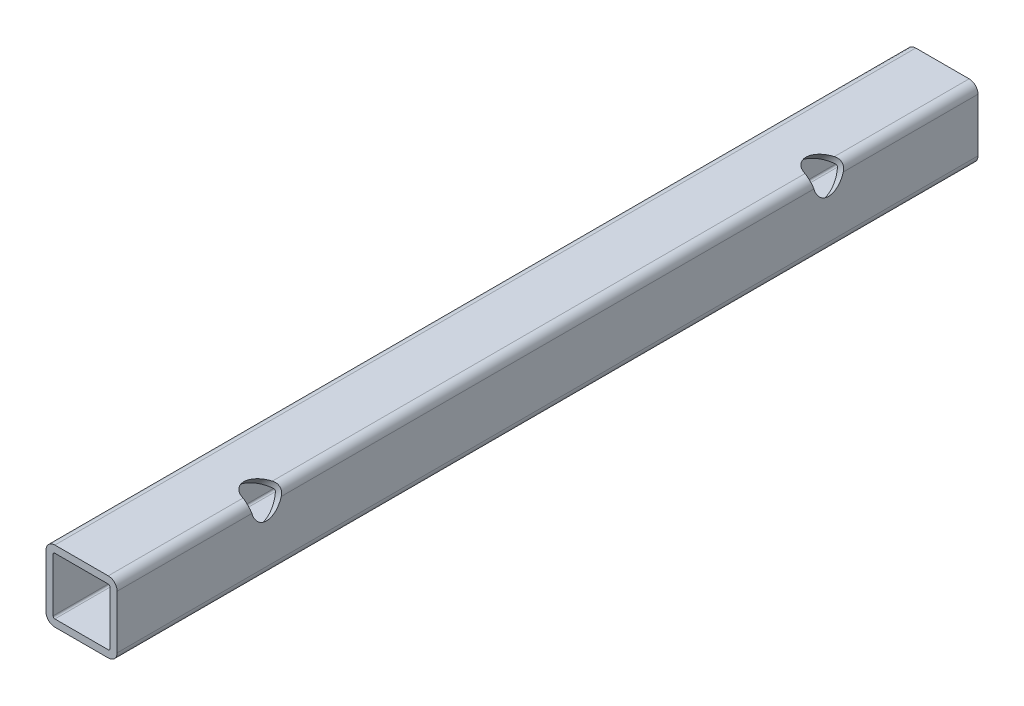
from build123d import *

# Parameters (mm, degrees)
BOSS_EXTRU_1_DEPTH      = 121
ENL_V_MAT_EXTRU_1_REACH = 126.03
ESQUISSE3_R             = 4.5


with BuildPart() as part:
    # Esquisse2 → Boss.-Extru.1 (new, symmetric)
    with BuildSketch(Plane.XY):
        with BuildLine():
            Line((-7.5, 10), (7.5, 10))
            ThreePointArc((7.5, 10), (9.267766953, 9.267766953), (10, 7.5))
            Line((10, 7.5), (10, -7.5))
            ThreePointArc((10, -7.5), (9.267766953, -9.267766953), (7.5, -10))
            Line((7.5, -10), (-7.5, -10))
            ThreePointArc((-7.5, -10), (-9.267766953, -9.267766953), (-10, -7.5))
            Line((-10, -7.5), (-10, 7.5))
            ThreePointArc((-10, 7.5), (-9.267766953, 9.267766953), (-7.5, 10))
        make_face()
        with BuildLine():
            Line((-7.5, 8), (7.5, 8))
            ThreePointArc((7.5, 8), (7.853553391, 7.853553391), (8, 7.5))
            Line((8, 7.5), (8, -7.5))
            ThreePointArc((8, -7.5), (7.853553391, -7.853553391), (7.5, -8))
            Line((7.5, -8), (-7.5, -8))
            ThreePointArc((-7.5, -8), (-7.853553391, -7.853553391), (-8, -7.5))
            Line((-8, -7.5), (-8, 7.5))
            ThreePointArc((-8, 7.5), (-7.853553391, 7.853553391), (-7.5, 8))
        make_face(mode=Mode.SUBTRACT)
    extrude(amount=BOSS_EXTRU_1_DEPTH, both=True)

    # Esquisse3 → Enl_v. mat.-Extru.1 (cut, up to next)
    with BuildSketch(Plane(origin=(9.267766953, 9.267766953, 0), x_dir=(0, 0, -1), z_dir=(0.7071067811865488, 0.7071067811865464, 0)), mode=Mode.PRIVATE) as enl_v_mat_extru_1_sk1:
        with Locations(Location((-79, 0, 0), (0, 0, 156.868852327))):
            Circle(ESQUISSE3_R)
    enl_v_mat_extru_1_tool1 = extrude(enl_v_mat_extru_1_sk1.sketch, amount=-ENL_V_MAT_EXTRU_1_REACH, mode=Mode.PRIVATE) & part.part
    # Esquisse3 → Enl_v. mat.-Extru.1 (cut, up to next)
    with BuildSketch(Plane(origin=(9.267766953, 9.267766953, 0), x_dir=(0, 0, -1), z_dir=(0.7071067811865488, 0.7071067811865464, 0)), mode=Mode.PRIVATE) as enl_v_mat_extru_1_sk2:
        with Locations(Location((79, 0, 0), (0, 0, 156.868852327))):
            Circle(ESQUISSE3_R)
    enl_v_mat_extru_1_tool2 = extrude(enl_v_mat_extru_1_sk2.sketch, amount=-ENL_V_MAT_EXTRU_1_REACH, mode=Mode.PRIVATE) & part.part
    add(enl_v_mat_extru_1_tool1.solids().sort_by_distance((9.267767, 9.267767, 79))[0], mode=Mode.SUBTRACT)
    add(enl_v_mat_extru_1_tool2.solids().sort_by_distance((9.267767, 9.267767, -79))[0], mode=Mode.SUBTRACT)


solid = part.part
